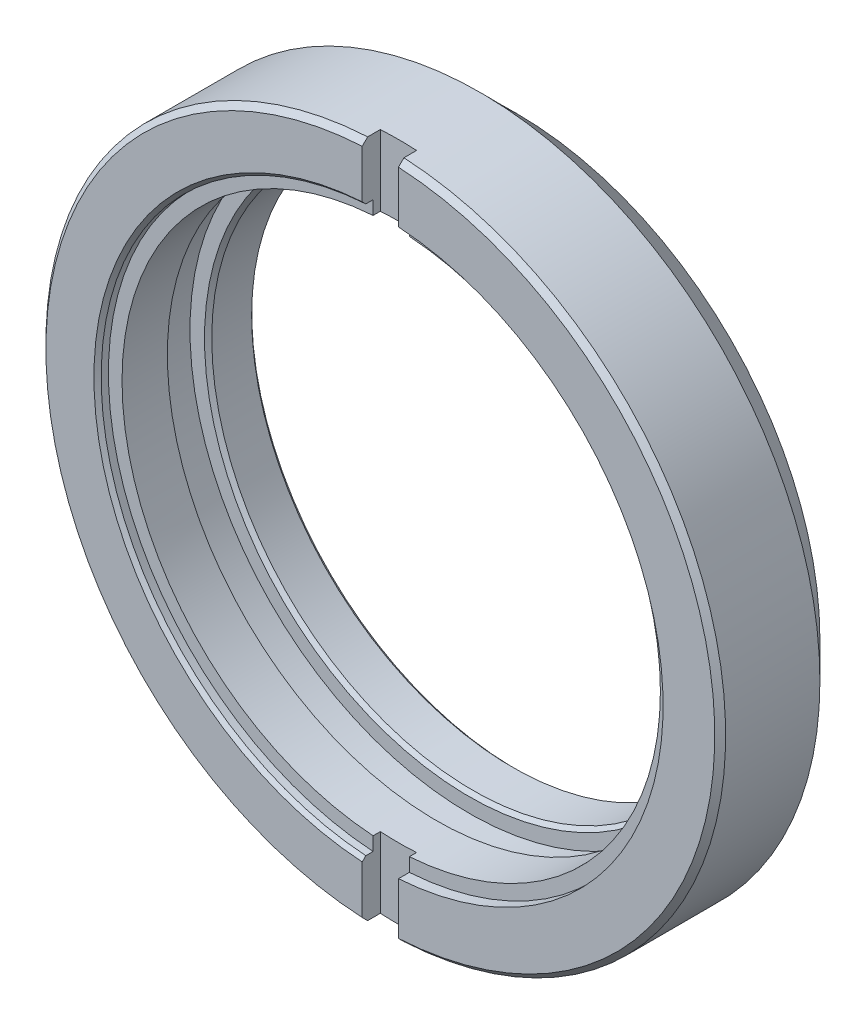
ISO-10303-21;
HEADER;
FILE_DESCRIPTION(('STEP AP214'),'2;1');
FILE_NAME('part.step','',(''),(''),'','','');
FILE_SCHEMA(('AUTOMOTIVE_DESIGN { 1 0 10303 214 1 1 1 1 }'));
ENDSEC;
DATA;
#1=APPLICATION_CONTEXT('core data for automotive mechanical design processes');
#2=APPLICATION_PROTOCOL_DEFINITION('international standard','automotive_design',2000,#1);
#3=PRODUCT_CONTEXT('',#1,'mechanical');
#4=PRODUCT('Part','Part','',(#3));
#5=PRODUCT_RELATED_PRODUCT_CATEGORY('part','',(#4));
#6=PRODUCT_DEFINITION_FORMATION('','',#4);
#7=PRODUCT_DEFINITION_CONTEXT('part definition',#1,'design');
#8=PRODUCT_DEFINITION('design','',#6,#7);
#9=PRODUCT_DEFINITION_SHAPE('','',#8);
#10=(LENGTH_UNIT() NAMED_UNIT(*) SI_UNIT(.MILLI.,.METRE.));
#11=(NAMED_UNIT(*) PLANE_ANGLE_UNIT() SI_UNIT($,.RADIAN.));
#12=(NAMED_UNIT(*) SI_UNIT($,.STERADIAN.) SOLID_ANGLE_UNIT());
#13=UNCERTAINTY_MEASURE_WITH_UNIT(LENGTH_MEASURE(1.E-05),#10,'distance_accuracy_value','');
#14=(GEOMETRIC_REPRESENTATION_CONTEXT(3) GLOBAL_UNCERTAINTY_ASSIGNED_CONTEXT((#13)) GLOBAL_UNIT_ASSIGNED_CONTEXT((#10,
#11,#12)) REPRESENTATION_CONTEXT('',''));
#15=CARTESIAN_POINT('',(0.,0.,0.));
#16=DIRECTION('',(0.,0.,1.));
#17=DIRECTION('',(1.,0.,0.));
#18=AXIS2_PLACEMENT_3D('',#15,#16,#17);
#19=CARTESIAN_POINT('',(0.,0.,9.525));
#20=DIRECTION('',(0.,0.,1.));
#21=DIRECTION('',(1.,0.,0.));
#22=AXIS2_PLACEMENT_3D('',#19,#20,#21);
#23=PLANE('',#22);
#24=DIRECTION('',(0.,-1.,0.));
#25=VECTOR('',#24,1.);
#26=CARTESIAN_POINT('',(-1.27,25.4,9.525));
#27=LINE('',#26,#25);
#28=CARTESIAN_POINT('',(-1.26999999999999,-20.0257697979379,9.525));
#29=VERTEX_POINT('',#28);
#30=CARTESIAN_POINT('',(-1.26999999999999,-23.397057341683,9.525));
#31=VERTEX_POINT('',#30);
#32=EDGE_CURVE('E165',#29,#31,#27,.T.);
#33=ORIENTED_EDGE('',*,*,#32,.F.);
#34=CARTESIAN_POINT('',(0.,0.,9.525));
#35=DIRECTION('',(0.,0.,1.));
#36=DIRECTION('',(1.,0.,0.));
#37=AXIS2_PLACEMENT_3D('',#34,#35,#36);
#38=CIRCLE('',#37,20.066);
#39=CARTESIAN_POINT('',(-1.27,20.0257697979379,9.525));
#40=VERTEX_POINT('',#39);
#41=EDGE_CURVE('E51',#29,#40,#38,.F.);
#42=ORIENTED_EDGE('',*,*,#41,.T.);
#43=CARTESIAN_POINT('',(-1.27,23.397057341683,9.525));
#44=VERTEX_POINT('',#43);
#45=EDGE_CURVE('E150',#44,#40,#27,.T.);
#46=ORIENTED_EDGE('',*,*,#45,.F.);
#47=CARTESIAN_POINT('',(0.,0.,9.525));
#48=DIRECTION('',(0.,0.,1.));
#49=DIRECTION('',(1.,0.,0.));
#50=AXIS2_PLACEMENT_3D('',#47,#48,#49);
#51=CIRCLE('',#50,23.4315000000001);
#52=EDGE_CURVE('E163',#44,#31,#51,.T.);
#53=ORIENTED_EDGE('',*,*,#52,.T.);
#54=EDGE_LOOP('',(#33,#42,#46,#53));
#55=FACE_BOUND('',#54,.T.);
#56=ADVANCED_FACE('F37',(#55),#23,.T.);
#57=CARTESIAN_POINT('',(0.,0.,8.763));
#58=DIRECTION('',(0.,0.,1.));
#59=DIRECTION('',(1.,0.,0.));
#60=AXIS2_PLACEMENT_3D('',#57,#58,#59);
#61=CYLINDRICAL_SURFACE('',#60,19.812);
#62=DIRECTION('',(0.,0.,1.));
#63=VECTOR('',#62,1.);
#64=CARTESIAN_POINT('',(-1.27,19.7712529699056,8.763));
#65=LINE('',#64,#63);
#66=CARTESIAN_POINT('',(-1.27,19.7712529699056,8.763));
#67=VERTEX_POINT('',#66);
#68=CARTESIAN_POINT('',(-1.27,19.7712529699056,9.27099999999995));
#69=VERTEX_POINT('',#68);
#70=EDGE_CURVE('E277',#67,#69,#65,.T.);
#71=ORIENTED_EDGE('',*,*,#70,.T.);
#72=CARTESIAN_POINT('',(0.,0.,9.27099999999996));
#73=DIRECTION('',(0.,0.,1.));
#74=DIRECTION('',(1.,0.,0.));
#75=AXIS2_PLACEMENT_3D('',#72,#73,#74);
#76=CIRCLE('',#75,19.812);
#77=CARTESIAN_POINT('',(-1.26999999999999,-19.7712529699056,9.27099999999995));
#78=VERTEX_POINT('',#77);
#79=EDGE_CURVE('E221',#69,#78,#76,.T.);
#80=ORIENTED_EDGE('',*,*,#79,.T.);
#81=DIRECTION('',(0.,0.,1.));
#82=VECTOR('',#81,1.);
#83=CARTESIAN_POINT('',(-1.26999999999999,-19.7712529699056,8.763));
#84=LINE('',#83,#82);
#85=CARTESIAN_POINT('',(-1.26999999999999,-19.7712529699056,8.763));
#86=VERTEX_POINT('',#85);
#87=EDGE_CURVE('E279',#78,#86,#84,.F.);
#88=ORIENTED_EDGE('',*,*,#87,.T.);
#89=CARTESIAN_POINT('',(0.,0.,8.763));
#90=DIRECTION('',(0.,0.,1.));
#91=DIRECTION('',(1.,0.,0.));
#92=AXIS2_PLACEMENT_3D('',#89,#90,#91);
#93=CIRCLE('',#92,19.812);
#94=EDGE_CURVE('E176',#67,#86,#93,.T.);
#95=ORIENTED_EDGE('',*,*,#94,.F.);
#96=EDGE_LOOP('',(#71,#80,#88,#95));
#97=FACE_BOUND('',#96,.T.);
#98=ADVANCED_FACE('F339',(#97),#61,.F.);
#99=CARTESIAN_POINT('',(0.,0.,8.763));
#100=DIRECTION('',(0.,0.,1.));
#101=DIRECTION('',(1.,0.,0.));
#102=AXIS2_PLACEMENT_3D('',#99,#100,#101);
#103=PLANE('',#102);
#104=DIRECTION('',(0.,-1.,0.));
#105=VECTOR('',#104,1.);
#106=CARTESIAN_POINT('',(-1.27,0.,8.763));
#107=LINE('',#106,#105);
#108=CARTESIAN_POINT('',(-1.27,18.816690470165,8.763));
#109=VERTEX_POINT('',#108);
#110=EDGE_CURVE('E281',#67,#109,#107,.T.);
#111=ORIENTED_EDGE('',*,*,#110,.F.);
#112=ORIENTED_EDGE('',*,*,#94,.T.);
#113=CARTESIAN_POINT('',(-1.26999999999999,-18.816690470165,8.763));
#114=VERTEX_POINT('',#113);
#115=EDGE_CURVE('E276',#114,#86,#107,.T.);
#116=ORIENTED_EDGE('',*,*,#115,.F.);
#117=CARTESIAN_POINT('',(0.,0.,8.763));
#118=DIRECTION('',(0.,0.,1.));
#119=DIRECTION('',(1.,0.,0.));
#120=AXIS2_PLACEMENT_3D('',#117,#118,#119);
#121=CIRCLE('',#120,18.8595);
#122=EDGE_CURVE('E275',#109,#114,#121,.T.);
#123=ORIENTED_EDGE('',*,*,#122,.F.);
#124=EDGE_LOOP('',(#111,#112,#116,#123));
#125=FACE_BOUND('',#124,.T.);
#126=ADVANCED_FACE('F337',(#125),#103,.T.);
#127=CARTESIAN_POINT('',(0.,0.,9.525));
#128=DIRECTION('',(0.,0.,-1.));
#129=DIRECTION('',(-1.,0.,0.));
#130=AXIS2_PLACEMENT_3D('',#127,#128,#129);
#131=CONICAL_SURFACE('',#130,23.4315000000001,0.785398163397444);
#132=CARTESIAN_POINT('',(-1.27,52.3732185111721,-19.43211438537));
#133=CARTESIAN_POINT('',(-1.27,50.5669869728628,-17.6264180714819));
#134=CARTESIAN_POINT('',(-1.27,48.7607321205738,-15.8207450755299));
#135=CARTESIAN_POINT('',(-1.27,45.1481445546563,-12.2094756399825));
#136=CARTESIAN_POINT('',(-1.27,43.3418118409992,-10.4038792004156));
#137=CARTESIAN_POINT('',(-1.27,39.7290233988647,-6.79277888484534));
#138=CARTESIAN_POINT('',(-1.27,37.9225676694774,-4.98727500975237));
#139=CARTESIAN_POINT('',(-1.27,34.3094935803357,-1.37643128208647));
#140=CARTESIAN_POINT('',(-1.27,32.5028752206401,0.428908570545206));
#141=CARTESIAN_POINT('',(-1.27,28.8846357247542,4.04405480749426));
#142=CARTESIAN_POINT('',(-1.27,27.0730138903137,5.85386049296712));
#143=CARTESIAN_POINT('',(-1.27,23.4493059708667,9.47301093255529));
#144=CARTESIAN_POINT('',(-1.27,21.6372198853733,11.2823556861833));
#145=CARTESIAN_POINT('',(-1.27,18.9183674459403,13.995638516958));
#146=CARTESIAN_POINT('',(-1.27,18.0119651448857,14.8999413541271));
#147=CARTESIAN_POINT('',(-1.27,16.1987724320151,16.7081586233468));
#148=CARTESIAN_POINT('',(-1.27,15.2919820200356,17.6120730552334));
#149=CARTESIAN_POINT('',(-1.27,13.477771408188,19.4192664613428));
#150=CARTESIAN_POINT('',(-1.27,12.5703512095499,20.3225454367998));
#151=CARTESIAN_POINT('',(-1.27,11.2083226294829,21.6765597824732));
#152=CARTESIAN_POINT('',(-1.27,10.7541635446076,22.1277470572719));
#153=CARTESIAN_POINT('',(-1.27,9.84540588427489,23.0296787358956));
#154=CARTESIAN_POINT('',(-1.27,9.39080730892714,23.480423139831));
#155=CARTESIAN_POINT('',(-1.27,8.68687210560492,24.1773522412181));
#156=CARTESIAN_POINT('',(-1.27,8.43777023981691,24.4237740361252));
#157=CARTESIAN_POINT('',(-1.27,7.93930374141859,24.9163519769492));
#158=CARTESIAN_POINT('',(-1.27,7.6899391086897,25.1625081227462));
#159=CARTESIAN_POINT('',(-1.27,7.19093909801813,25.6543951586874));
#160=CARTESIAN_POINT('',(-1.27,6.9413038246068,25.9001261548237));
#161=CARTESIAN_POINT('',(-1.27,6.44155850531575,26.3911043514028));
#162=CARTESIAN_POINT('',(-1.27,6.19144845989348,26.6363515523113));
#163=CARTESIAN_POINT('',(-1.27,5.60594682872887,27.2089324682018));
#164=CARTESIAN_POINT('',(-1.27,5.27029571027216,27.5360013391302));
#165=CARTESIAN_POINT('',(-1.27,4.76520617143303,28.0251353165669));
#166=CARTESIAN_POINT('',(-1.27,4.59652520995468,28.1879819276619));
#167=CARTESIAN_POINT('',(-1.27,4.25845992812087,28.5129411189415));
#168=CARTESIAN_POINT('',(-1.27,4.08907561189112,28.6750537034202));
#169=CARTESIAN_POINT('',(-1.27,3.69171843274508,29.0530831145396));
#170=CARTESIAN_POINT('',(-1.27,3.4633612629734,29.2685980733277));
#171=CARTESIAN_POINT('',(-1.27,3.118785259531,29.5893048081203));
#172=CARTESIAN_POINT('',(-1.27,3.00368141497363,29.6956935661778));
#173=CARTESIAN_POINT('',(-1.27,2.77246129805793,29.9073599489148));
#174=CARTESIAN_POINT('',(-1.27,2.65634506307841,30.0126376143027));
#175=CARTESIAN_POINT('',(-1.27,2.46135241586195,30.1870340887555));
#176=CARTESIAN_POINT('',(-1.27,2.38286764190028,30.2565903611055));
#177=CARTESIAN_POINT('',(-1.27,2.22508436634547,30.3947728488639));
#178=CARTESIAN_POINT('',(-1.27,2.14578588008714,30.463399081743));
#179=CARTESIAN_POINT('',(-1.27,1.98571326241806,30.5997674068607));
#180=CARTESIAN_POINT('',(-1.27,1.90493358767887,30.6675030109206));
#181=CARTESIAN_POINT('',(-1.27,1.74197276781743,30.8012280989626));
#182=CARTESIAN_POINT('',(-1.27,1.65979202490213,30.8672180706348));
#183=CARTESIAN_POINT('',(-1.27,1.49261318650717,30.997417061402));
#184=CARTESIAN_POINT('',(-1.27,1.40759443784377,31.061599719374));
#185=CARTESIAN_POINT('',(-1.27,1.23467633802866,31.1862679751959));
#186=CARTESIAN_POINT('',(-1.27,1.14677335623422,31.2467486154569));
#187=CARTESIAN_POINT('',(-1.27,0.967758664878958,31.361278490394));
#188=CARTESIAN_POINT('',(-1.27,0.876676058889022,31.4153726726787));
#189=CARTESIAN_POINT('',(-1.27,0.689355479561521,31.5136610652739));
#190=CARTESIAN_POINT('',(-1.27,0.593134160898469,31.55788510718));
#191=CARTESIAN_POINT('',(-1.27,0.456123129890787,31.6075300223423));
#192=CARTESIAN_POINT('',(-1.27,0.417903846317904,31.6200215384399));
#193=CARTESIAN_POINT('',(-1.27,0.340629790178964,31.6421345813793));
#194=CARTESIAN_POINT('',(-1.27,0.301574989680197,31.651756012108));
#195=CARTESIAN_POINT('',(-1.27,0.222934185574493,31.6676538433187));
#196=CARTESIAN_POINT('',(-1.27,0.183350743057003,31.6739427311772));
#197=CARTESIAN_POINT('',(-1.27,0.103776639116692,31.6828800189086));
#198=CARTESIAN_POINT('',(-1.27,0.0637860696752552,31.6855292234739));
#199=CARTESIAN_POINT('',(-1.27,-0.0164801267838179,31.6870303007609));
#200=CARTESIAN_POINT('',(-1.27,-0.0567561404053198,31.6858619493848));
#201=CARTESIAN_POINT('',(-1.27,-0.137018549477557,31.6797573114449));
#202=CARTESIAN_POINT('',(-1.27,-0.177004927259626,31.6748207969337));
#203=CARTESIAN_POINT('',(-1.27,-0.256510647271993,31.6614495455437));
#204=CARTESIAN_POINT('',(-1.27,-0.29602809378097,31.653003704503));
#205=CARTESIAN_POINT('',(-1.27,-0.374269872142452,31.6330400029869));
#206=CARTESIAN_POINT('',(-1.27,-0.412994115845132,31.6215218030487));
#207=CARTESIAN_POINT('',(-1.27,-0.530517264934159,31.5821764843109));
#208=CARTESIAN_POINT('',(-1.27,-0.607886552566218,31.5500809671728));
#209=CARTESIAN_POINT('',(-1.27,-0.75910042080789,31.4784341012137));
#210=CARTESIAN_POINT('',(-1.27,-0.832938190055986,31.4388690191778));
#211=CARTESIAN_POINT('',(-1.27,-0.978284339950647,31.3544952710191));
#212=CARTESIAN_POINT('',(-1.27,-1.04977023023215,31.3096483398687));
#213=CARTESIAN_POINT('',(-1.27,-1.15526138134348,31.2398633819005));
#214=CARTESIAN_POINT('',(-1.27,-1.19012177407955,31.2161926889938));
#215=CARTESIAN_POINT('',(-1.27,-1.25934743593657,31.1681390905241));
#216=CARTESIAN_POINT('',(-1.27,-1.29371272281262,31.1437562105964));
#217=CARTESIAN_POINT('',(-1.27,-1.40233300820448,31.0652628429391));
#218=CARTESIAN_POINT('',(-1.27,-1.47578391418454,31.0100405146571));
#219=CARTESIAN_POINT('',(-1.27,-1.62116665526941,30.8976251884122));
#220=CARTESIAN_POINT('',(-1.27,-1.69309824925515,30.8404318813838));
#221=CARTESIAN_POINT('',(-1.27,-1.83583108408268,30.7245867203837));
#222=CARTESIAN_POINT('',(-1.27,-1.90663176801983,30.6659341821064));
#223=CARTESIAN_POINT('',(-1.27,-2.0473299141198,30.5475538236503));
#224=CARTESIAN_POINT('',(-1.27,-2.11722734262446,30.487825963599));
#225=CARTESIAN_POINT('',(-1.27,-2.32610511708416,30.3072121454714));
#226=CARTESIAN_POINT('',(-1.27,-2.46402374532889,30.1850997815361));
#227=CARTESIAN_POINT('',(-1.27,-2.73799613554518,29.9388924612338));
#228=CARTESIAN_POINT('',(-1.27,-2.87405041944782,29.8147980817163));
#229=CARTESIAN_POINT('',(-1.27,-3.14449019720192,29.5656349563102));
#230=CARTESIAN_POINT('',(-1.27,-3.27887953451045,29.4405703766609));
#231=CARTESIAN_POINT('',(-1.27,-3.54678100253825,29.1894877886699));
#232=CARTESIAN_POINT('',(-1.27,-3.68029306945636,29.0634697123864));
#233=CARTESIAN_POINT('',(-1.27,-3.94652079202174,28.8108805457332));
#234=CARTESIAN_POINT('',(-1.27,-4.07923714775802,28.6843101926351));
#235=CARTESIAN_POINT('',(-1.27,-4.34417118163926,28.4306554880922));
#236=CARTESIAN_POINT('',(-1.27,-4.47638887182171,28.3035711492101));
#237=CARTESIAN_POINT('',(-1.27,-4.87128234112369,27.9228759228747));
#238=CARTESIAN_POINT('',(-1.27,-5.13339596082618,27.6686820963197));
#239=CARTESIAN_POINT('',(-1.27,-5.6566738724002,27.1593187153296));
#240=CARTESIAN_POINT('',(-1.27,-5.91783816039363,26.9041491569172));
#241=CARTESIAN_POINT('',(-1.27,-6.43952511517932,26.3931452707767));
#242=CARTESIAN_POINT('',(-1.27,-6.70004776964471,26.137310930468));
#243=CARTESIAN_POINT('',(-1.27,-7.22063494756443,25.6251764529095));
#244=CARTESIAN_POINT('',(-1.27,-7.48069947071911,25.3688763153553));
#245=CARTESIAN_POINT('',(-1.27,-8.26062032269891,24.5992532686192));
#246=CARTESIAN_POINT('',(-1.27,-8.77998020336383,24.0854273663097));
#247=CARTESIAN_POINT('',(-1.27,-9.8179329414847,23.0570112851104));
#248=CARTESIAN_POINT('',(-1.27,-10.3365258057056,22.5424211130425));
#249=CARTESIAN_POINT('',(-1.27,-11.3732633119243,21.5127074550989));
#250=CARTESIAN_POINT('',(-1.27,-11.8914079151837,20.9975839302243));
#251=CARTESIAN_POINT('',(-1.27,-12.9273684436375,19.9670040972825));
#252=CARTESIAN_POINT('',(-1.27,-13.4451843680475,19.4515477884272));
#253=CARTESIAN_POINT('',(-1.27,-14.9981407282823,17.9049811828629));
#254=CARTESIAN_POINT('',(-1.27,-16.0329377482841,16.8735260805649));
#255=CARTESIAN_POINT('',(-1.26999999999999,-18.5402176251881,14.3731551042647));
#256=CARTESIAN_POINT('',(-1.26999999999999,-20.0124487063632,12.9039868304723));
#257=CARTESIAN_POINT('',(-1.26999999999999,-22.9564096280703,9.96514732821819));
#258=CARTESIAN_POINT('',(-1.26999999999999,-24.4281394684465,8.4954760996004));
#259=CARTESIAN_POINT('',(-1.26999999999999,-27.3713959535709,5.55575117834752));
#260=CARTESIAN_POINT('',(-1.26999999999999,-28.8429225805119,4.08569746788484));
#261=CARTESIAN_POINT('',(-1.26999999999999,-31.7857915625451,1.14540590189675));
#262=CARTESIAN_POINT('',(-1.26999999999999,-33.2571339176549,-0.324831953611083));
#263=CARTESIAN_POINT('',(-1.26999999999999,-37.6696387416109,-4.73438514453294));
#264=CARTESIAN_POINT('',(-1.26999999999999,-40.6106210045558,-7.67388080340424));
#265=CARTESIAN_POINT('',(-1.26999999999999,-45.0218243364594,-12.0832143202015));
#266=CARTESIAN_POINT('',(-1.26999999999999,-46.4921354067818,-13.5529621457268));
#267=CARTESIAN_POINT('',(-1.26999999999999,-49.432709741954,-16.4925055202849));
#268=CARTESIAN_POINT('',(-1.26999999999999,-50.9029730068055,-17.9623010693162));
#269=CARTESIAN_POINT('',(-1.26999999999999,-52.3732185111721,-19.43211438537));
#270=B_SPLINE_CURVE_WITH_KNOTS('',3,(#132,#133,#134,#135,#136,#137,#138,#139,#140,#141,#142,
#143,#144,#145,#146,#147,#148,#149,#150,#151,#152,#153,#154,#155,#156,#157,#158,#159,#160,#161,
#162,#163,#164,#165,#166,#167,#168,#169,#170,#171,#172,#173,#174,#175,#176,#177,#178,#179,#180,
#181,#182,#183,#184,#185,#186,#187,#188,#189,#190,#191,#192,#193,#194,#195,#196,#197,#198,#199,
#200,#201,#202,#203,#204,#205,#206,#207,#208,#209,#210,#211,#212,#213,#214,#215,#216,#217,#218,
#219,#220,#221,#222,#223,#224,#225,#226,#227,#228,#229,#230,#231,#232,#233,#234,#235,#236,#237,
#238,#239,#240,#241,#242,#243,#244,#245,#246,#247,#248,#249,#250,#251,#252,#253,#254,#255,#256,
#257,#258,#259,#260,#261,#262,#263,#264,#265,#266,#267,#268,#269),.UNSPECIFIED.,.F.,.F.,(4,2,2,
2,2,2,2,2,2,2,2,2,2,2,2,2,2,2,2,2,2,2,2,2,2,2,2,2,2,2,2,2,2,2,2,2,2,2,2,2,2,2,2,2,2,2,2,2,2,2,2,
2,2,2,2,2,2,2,2,2,2,2,2,2,2,2,2,2,4),(0.,7.66205611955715,15.3241150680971,22.9862387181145,
30.6483596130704,38.3305684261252,46.0127853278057,49.8538734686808,53.6949632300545,
57.53604551,59.456585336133,61.3771246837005,62.4283043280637,63.4794844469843,64.5303470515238,
65.5812086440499,66.9871617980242,67.6905449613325,68.3939240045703,69.3358909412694,
69.8061067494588,70.2763052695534,70.5909130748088,70.905514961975,71.2217596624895,
71.5379150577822,71.8574284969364,72.1773608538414,72.4948871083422,72.8114402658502,
72.9319757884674,73.0525153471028,73.1725999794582,73.2926580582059,73.4133531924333,
73.5340556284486,73.6551429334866,73.7762436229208,74.0268487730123,74.2779192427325,
74.5309357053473,74.6573420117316,74.7837437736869,75.0593723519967,75.3350443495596,
75.6108481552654,75.8866622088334,76.4392512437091,76.9916822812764,77.5424156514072,
78.093188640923,78.6433714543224,79.1935409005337,80.2889184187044,81.3843004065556,
82.4797032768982,83.5751068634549,85.7668546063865,87.9585829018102,90.1504847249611,
92.3423917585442,96.7255797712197,102.965233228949,109.204888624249,115.444923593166,
121.684957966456,134.159335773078,140.396142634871,146.632949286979),.UNSPECIFIED.);
#271=CARTESIAN_POINT('',(-1.27,23.778609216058,9.14400000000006));
#272=VERTEX_POINT('',#271);
#273=EDGE_CURVE('E148',#272,#44,#270,.T.);
#274=ORIENTED_EDGE('',*,*,#273,.F.);
#275=CARTESIAN_POINT('',(0.,0.,9.14400000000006));
#276=DIRECTION('',(0.,0.,1.));
#277=DIRECTION('',(1.,0.,0.));
#278=AXIS2_PLACEMENT_3D('',#275,#276,#277);
#279=CIRCLE('',#278,23.8125);
#280=CARTESIAN_POINT('',(-1.26999999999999,-23.778609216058,9.14400000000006));
#281=VERTEX_POINT('',#280);
#282=EDGE_CURVE('E173',#281,#272,#279,.F.);
#283=ORIENTED_EDGE('',*,*,#282,.F.);
#284=EDGE_CURVE('E160',#31,#281,#270,.T.);
#285=ORIENTED_EDGE('',*,*,#284,.F.);
#286=ORIENTED_EDGE('',*,*,#52,.F.);
#287=EDGE_LOOP('',(#274,#283,#285,#286));
#288=FACE_BOUND('',#287,.T.);
#289=ADVANCED_FACE('F168',(#288),#131,.T.);
#290=CARTESIAN_POINT('',(0.,0.,9.525));
#291=DIRECTION('',(0.,0.,-1.));
#292=DIRECTION('',(-1.,0.,0.));
#293=AXIS2_PLACEMENT_3D('',#290,#291,#292);
#294=CYLINDRICAL_SURFACE('',#293,23.8125);
#295=CARTESIAN_POINT('',(0.,0.,2.54000000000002));
#296=DIRECTION('',(0.,0.,1.));
#297=DIRECTION('',(1.,0.,0.));
#298=AXIS2_PLACEMENT_3D('',#295,#296,#297);
#299=CIRCLE('',#298,23.8125);
#300=CARTESIAN_POINT('',(23.8125,0.,2.54000000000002));
#301=VERTEX_POINT('',#300);
#302=EDGE_CURVE('E243',#301,#301,#299,.T.);
#303=ORIENTED_EDGE('',*,*,#302,.T.);
#304=EDGE_LOOP('',(#303));
#305=FACE_BOUND('',#304,.T.);
#306=ORIENTED_EDGE('',*,*,#282,.T.);
#307=DIRECTION('',(0.,0.,-1.));
#308=VECTOR('',#307,1.);
#309=CARTESIAN_POINT('',(-1.27,23.778609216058,9.525));
#310=LINE('',#309,#308);
#311=CARTESIAN_POINT('',(-1.27,23.778609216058,8.255));
#312=VERTEX_POINT('',#311);
#313=EDGE_CURVE('E154',#272,#312,#310,.T.);
#314=ORIENTED_EDGE('',*,*,#313,.T.);
#315=CARTESIAN_POINT('',(0.,0.,8.255));
#316=DIRECTION('',(0.,0.,1.));
#317=DIRECTION('',(1.,0.,0.));
#318=AXIS2_PLACEMENT_3D('',#315,#316,#317);
#319=CIRCLE('',#318,23.8125);
#320=CARTESIAN_POINT('',(1.27,23.778609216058,8.255));
#321=VERTEX_POINT('',#320);
#322=EDGE_CURVE('E288',#321,#312,#319,.T.);
#323=ORIENTED_EDGE('',*,*,#322,.F.);
#324=DIRECTION('',(0.,0.,-1.));
#325=VECTOR('',#324,1.);
#326=CARTESIAN_POINT('',(1.27,23.778609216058,9.525));
#327=LINE('',#326,#325);
#328=CARTESIAN_POINT('',(1.27,23.778609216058,9.14400000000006));
#329=VERTEX_POINT('',#328);
#330=EDGE_CURVE('E315',#321,#329,#327,.F.);
#331=ORIENTED_EDGE('',*,*,#330,.T.);
#332=CARTESIAN_POINT('',(1.27000000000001,-23.778609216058,9.14400000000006));
#333=VERTEX_POINT('',#332);
#334=EDGE_CURVE('E169',#329,#333,#279,.F.);
#335=ORIENTED_EDGE('',*,*,#334,.T.);
#336=DIRECTION('',(0.,0.,-1.));
#337=VECTOR('',#336,1.);
#338=CARTESIAN_POINT('',(1.27000000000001,-23.778609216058,9.525));
#339=LINE('',#338,#337);
#340=CARTESIAN_POINT('',(1.27000000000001,-23.778609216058,8.255));
#341=VERTEX_POINT('',#340);
#342=EDGE_CURVE('E318',#333,#341,#339,.T.);
#343=ORIENTED_EDGE('',*,*,#342,.T.);
#344=CARTESIAN_POINT('',(-1.26999999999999,-23.778609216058,8.255));
#345=VERTEX_POINT('',#344);
#346=EDGE_CURVE('E286',#345,#341,#319,.T.);
#347=ORIENTED_EDGE('',*,*,#346,.F.);
#348=DIRECTION('',(0.,0.,-1.));
#349=VECTOR('',#348,1.);
#350=CARTESIAN_POINT('',(-1.26999999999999,-23.778609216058,9.525));
#351=LINE('',#350,#349);
#352=EDGE_CURVE('E267',#345,#281,#351,.F.);
#353=ORIENTED_EDGE('',*,*,#352,.T.);
#354=EDGE_LOOP('',(#306,#314,#323,#331,#335,#343,#347,#353));
#355=FACE_BOUND('',#354,.T.);
#356=ADVANCED_FACE('F359',(#305,#355),#294,.T.);
#357=DIRECTION('',(0.,1.,0.));
#358=VECTOR('',#357,1.);
#359=CARTESIAN_POINT('',(1.27,25.4,9.525));
#360=LINE('',#359,#358);
#361=CARTESIAN_POINT('',(1.27000000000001,-23.397057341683,9.525));
#362=VERTEX_POINT('',#361);
#363=CARTESIAN_POINT('',(1.27000000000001,-19.7712529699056,9.525));
#364=VERTEX_POINT('',#363);
#365=EDGE_CURVE('E269',#362,#364,#360,.T.);
#366=ORIENTED_EDGE('',*,*,#365,.F.);
#367=CARTESIAN_POINT('',(1.27,23.397057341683,9.525));
#368=VERTEX_POINT('',#367);
#369=EDGE_CURVE('E170',#362,#368,#51,.T.);
#370=ORIENTED_EDGE('',*,*,#369,.T.);
#371=CARTESIAN_POINT('',(1.27,19.7712529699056,9.525));
#372=VERTEX_POINT('',#371);
#373=EDGE_CURVE('E164',#372,#368,#360,.T.);
#374=ORIENTED_EDGE('',*,*,#373,.F.);
#375=CARTESIAN_POINT('',(0.,0.,9.525));
#376=DIRECTION('',(0.,0.,1.));
#377=DIRECTION('',(1.,0.,0.));
#378=AXIS2_PLACEMENT_3D('',#375,#376,#377);
#379=CIRCLE('',#378,19.812);
#380=EDGE_CURVE('E178',#364,#372,#379,.T.);
#381=ORIENTED_EDGE('',*,*,#380,.F.);
#382=EDGE_LOOP('',(#366,#370,#374,#381));
#383=FACE_BOUND('',#382,.T.);
#384=ADVANCED_FACE('F309',(#383),#23,.T.);
#385=CARTESIAN_POINT('',(0.,0.,0.));
#386=DIRECTION('',(0.,0.,1.));
#387=DIRECTION('',(1.,0.,0.));
#388=AXIS2_PLACEMENT_3D('',#385,#386,#387);
#389=PLANE('',#388);
#390=CARTESIAN_POINT('',(0.,0.,0.));
#391=DIRECTION('',(0.,0.,1.));
#392=DIRECTION('',(1.,0.,0.));
#393=AXIS2_PLACEMENT_3D('',#390,#391,#392);
#394=CIRCLE('',#393,18.542);
#395=CARTESIAN_POINT('',(18.542,0.,0.));
#396=VERTEX_POINT('',#395);
#397=EDGE_CURVE('E224',#396,#396,#394,.T.);
#398=ORIENTED_EDGE('',*,*,#397,.T.);
#399=EDGE_LOOP('',(#398));
#400=FACE_BOUND('',#399,.T.);
#401=CARTESIAN_POINT('',(0.,0.,0.));
#402=DIRECTION('',(0.,0.,1.));
#403=DIRECTION('',(1.,0.,0.));
#404=AXIS2_PLACEMENT_3D('',#401,#402,#403);
#405=CIRCLE('',#404,21.2725);
#406=CARTESIAN_POINT('',(21.2725,0.,0.));
#407=VERTEX_POINT('',#406);
#408=EDGE_CURVE('E236',#407,#407,#405,.F.);
#409=ORIENTED_EDGE('',*,*,#408,.T.);
#410=EDGE_LOOP('',(#409));
#411=FACE_BOUND('',#410,.T.);
#412=ADVANCED_FACE('F358',(#400,#411),#389,.F.);
#413=ORIENTED_EDGE('',*,*,#380,.T.);
#414=DIRECTION('',(0.,0.,1.));
#415=VECTOR('',#414,1.);
#416=CARTESIAN_POINT('',(1.27,19.7712529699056,8.763));
#417=LINE('',#416,#415);
#418=CARTESIAN_POINT('',(1.27,19.7712529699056,8.763));
#419=VERTEX_POINT('',#418);
#420=EDGE_CURVE('E304',#372,#419,#417,.F.);
#421=ORIENTED_EDGE('',*,*,#420,.T.);
#422=CARTESIAN_POINT('',(1.27000000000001,-19.7712529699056,8.763));
#423=VERTEX_POINT('',#422);
#424=EDGE_CURVE('E291',#423,#419,#93,.T.);
#425=ORIENTED_EDGE('',*,*,#424,.F.);
#426=DIRECTION('',(0.,0.,1.));
#427=VECTOR('',#426,1.);
#428=CARTESIAN_POINT('',(1.27000000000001,-19.7712529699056,8.763));
#429=LINE('',#428,#427);
#430=EDGE_CURVE('E305',#423,#364,#429,.T.);
#431=ORIENTED_EDGE('',*,*,#430,.T.);
#432=EDGE_LOOP('',(#413,#421,#425,#431));
#433=FACE_BOUND('',#432,.T.);
#434=ADVANCED_FACE('F303',(#433),#61,.F.);
#435=DIRECTION('',(0.,1.,0.));
#436=VECTOR('',#435,1.);
#437=CARTESIAN_POINT('',(1.27,0.,8.763));
#438=LINE('',#437,#436);
#439=CARTESIAN_POINT('',(1.27000000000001,-18.816690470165,8.763));
#440=VERTEX_POINT('',#439);
#441=EDGE_CURVE('E323',#423,#440,#438,.T.);
#442=ORIENTED_EDGE('',*,*,#441,.F.);
#443=ORIENTED_EDGE('',*,*,#424,.T.);
#444=CARTESIAN_POINT('',(1.27,18.816690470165,8.763));
#445=VERTEX_POINT('',#444);
#446=EDGE_CURVE('E325',#445,#419,#438,.T.);
#447=ORIENTED_EDGE('',*,*,#446,.F.);
#448=EDGE_CURVE('E289',#440,#445,#121,.T.);
#449=ORIENTED_EDGE('',*,*,#448,.F.);
#450=EDGE_LOOP('',(#442,#443,#447,#449));
#451=FACE_BOUND('',#450,.T.);
#452=ADVANCED_FACE('F397',(#451),#103,.T.);
#453=CARTESIAN_POINT('',(0.,0.,3.302));
#454=DIRECTION('',(0.,0.,1.));
#455=DIRECTION('',(1.,0.,0.));
#456=AXIS2_PLACEMENT_3D('',#453,#454,#455);
#457=CYLINDRICAL_SURFACE('',#456,18.8595);
#458=CARTESIAN_POINT('',(0.,0.,5.588));
#459=DIRECTION('',(0.,0.,1.));
#460=DIRECTION('',(1.,0.,0.));
#461=AXIS2_PLACEMENT_3D('',#458,#459,#460);
#462=CIRCLE('',#461,18.8595);
#463=CARTESIAN_POINT('',(18.8595,0.,5.588));
#464=VERTEX_POINT('',#463);
#465=EDGE_CURVE('E237',#464,#464,#462,.F.);
#466=ORIENTED_EDGE('',*,*,#465,.T.);
#467=EDGE_LOOP('',(#466));
#468=FACE_BOUND('',#467,.T.);
#469=ORIENTED_EDGE('',*,*,#122,.T.);
#470=DIRECTION('',(0.,0.,1.));
#471=VECTOR('',#470,1.);
#472=CARTESIAN_POINT('',(-1.26999999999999,-18.816690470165,3.302));
#473=LINE('',#472,#471);
#474=CARTESIAN_POINT('',(-1.26999999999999,-18.816690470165,8.255));
#475=VERTEX_POINT('',#474);
#476=EDGE_CURVE('E264',#114,#475,#473,.F.);
#477=ORIENTED_EDGE('',*,*,#476,.T.);
#478=CARTESIAN_POINT('',(0.,0.,8.255));
#479=DIRECTION('',(0.,0.,1.));
#480=DIRECTION('',(1.,0.,0.));
#481=AXIS2_PLACEMENT_3D('',#478,#479,#480);
#482=CIRCLE('',#481,18.8595);
#483=CARTESIAN_POINT('',(1.27000000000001,-18.816690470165,8.255));
#484=VERTEX_POINT('',#483);
#485=EDGE_CURVE('E245',#484,#475,#482,.F.);
#486=ORIENTED_EDGE('',*,*,#485,.F.);
#487=DIRECTION('',(0.,0.,1.));
#488=VECTOR('',#487,1.);
#489=CARTESIAN_POINT('',(1.27000000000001,-18.816690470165,3.302));
#490=LINE('',#489,#488);
#491=EDGE_CURVE('E321',#484,#440,#490,.T.);
#492=ORIENTED_EDGE('',*,*,#491,.T.);
#493=ORIENTED_EDGE('',*,*,#448,.T.);
#494=DIRECTION('',(0.,0.,1.));
#495=VECTOR('',#494,1.);
#496=CARTESIAN_POINT('',(1.27,18.816690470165,3.302));
#497=LINE('',#496,#495);
#498=CARTESIAN_POINT('',(1.27,18.816690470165,8.255));
#499=VERTEX_POINT('',#498);
#500=EDGE_CURVE('E327',#445,#499,#497,.F.);
#501=ORIENTED_EDGE('',*,*,#500,.T.);
#502=CARTESIAN_POINT('',(-1.27,18.816690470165,8.255));
#503=VERTEX_POINT('',#502);
#504=EDGE_CURVE('E159',#503,#499,#482,.F.);
#505=ORIENTED_EDGE('',*,*,#504,.F.);
#506=DIRECTION('',(0.,0.,1.));
#507=VECTOR('',#506,1.);
#508=CARTESIAN_POINT('',(-1.27,18.816690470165,3.302));
#509=LINE('',#508,#507);
#510=EDGE_CURVE('E333',#503,#109,#509,.T.);
#511=ORIENTED_EDGE('',*,*,#510,.T.);
#512=EDGE_LOOP('',(#469,#477,#486,#492,#493,#501,#505,#511));
#513=FACE_BOUND('',#512,.T.);
#514=ADVANCED_FACE('F272',(#468,#513),#457,.F.);
#515=CARTESIAN_POINT('',(0.,0.,3.302));
#516=DIRECTION('',(0.,0.,1.));
#517=DIRECTION('',(1.,0.,0.));
#518=AXIS2_PLACEMENT_3D('',#515,#516,#517);
#519=PLANE('',#518);
#520=CARTESIAN_POINT('',(0.,0.,3.302));
#521=DIRECTION('',(0.,0.,1.));
#522=DIRECTION('',(1.,0.,0.));
#523=AXIS2_PLACEMENT_3D('',#520,#521,#522);
#524=CIRCLE('',#523,18.542);
#525=CARTESIAN_POINT('',(18.542,0.,3.302));
#526=VERTEX_POINT('',#525);
#527=EDGE_CURVE('E227',#526,#526,#524,.F.);
#528=ORIENTED_EDGE('',*,*,#527,.T.);
#529=EDGE_LOOP('',(#528));
#530=FACE_BOUND('',#529,.T.);
#531=CARTESIAN_POINT('',(0.,0.,3.302));
#532=DIRECTION('',(0.,0.,1.));
#533=DIRECTION('',(1.,0.,0.));
#534=AXIS2_PLACEMENT_3D('',#531,#532,#533);
#535=CIRCLE('',#534,19.558);
#536=CARTESIAN_POINT('',(19.558,0.,3.302));
#537=VERTEX_POINT('',#536);
#538=EDGE_CURVE('E379',#537,#537,#535,.T.);
#539=ORIENTED_EDGE('',*,*,#538,.T.);
#540=EDGE_LOOP('',(#539));
#541=FACE_BOUND('',#540,.T.);
#542=ADVANCED_FACE('F396',(#530,#541),#519,.T.);
#543=CARTESIAN_POINT('',(0.,0.,0.));
#544=DIRECTION('',(0.,0.,1.));
#545=DIRECTION('',(1.,0.,0.));
#546=AXIS2_PLACEMENT_3D('',#543,#544,#545);
#547=CYLINDRICAL_SURFACE('',#546,18.288);
#548=CARTESIAN_POINT('',(0.,0.,3.048));
#549=DIRECTION('',(0.,0.,1.));
#550=DIRECTION('',(1.,0.,0.));
#551=AXIS2_PLACEMENT_3D('',#548,#549,#550);
#552=CIRCLE('',#551,18.288);
#553=CARTESIAN_POINT('',(18.288,0.,3.048));
#554=VERTEX_POINT('',#553);
#555=EDGE_CURVE('E230',#554,#554,#552,.T.);
#556=ORIENTED_EDGE('',*,*,#555,.T.);
#557=EDGE_LOOP('',(#556));
#558=FACE_BOUND('',#557,.T.);
#559=CARTESIAN_POINT('',(0.,0.,0.25399999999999));
#560=DIRECTION('',(0.,0.,1.));
#561=DIRECTION('',(1.,0.,0.));
#562=AXIS2_PLACEMENT_3D('',#559,#560,#561);
#563=CIRCLE('',#562,18.288);
#564=CARTESIAN_POINT('',(18.288,0.,0.25399999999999));
#565=VERTEX_POINT('',#564);
#566=EDGE_CURVE('E233',#565,#565,#563,.F.);
#567=ORIENTED_EDGE('',*,*,#566,.T.);
#568=EDGE_LOOP('',(#567));
#569=FACE_BOUND('',#568,.T.);
#570=ADVANCED_FACE('F211',(#558,#569),#547,.F.);
#571=CARTESIAN_POINT('',(1.27000000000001,-52.373218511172,-19.43211438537));
#572=CARTESIAN_POINT('',(1.27000000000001,-50.5669869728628,-17.6264180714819));
#573=CARTESIAN_POINT('',(1.27000000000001,-48.7607321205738,-15.8207450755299));
#574=CARTESIAN_POINT('',(1.27000000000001,-45.1481445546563,-12.2094756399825));
#575=CARTESIAN_POINT('',(1.27000000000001,-43.3418118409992,-10.4038792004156));
#576=CARTESIAN_POINT('',(1.27000000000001,-39.7290233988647,-6.79277888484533));
#577=CARTESIAN_POINT('',(1.27000000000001,-37.9225676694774,-4.98727500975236));
#578=CARTESIAN_POINT('',(1.27000000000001,-34.3094935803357,-1.37643128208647));
#579=CARTESIAN_POINT('',(1.27000000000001,-32.5028752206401,0.428908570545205));
#580=CARTESIAN_POINT('',(1.27000000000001,-28.8846357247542,4.04405480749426));
#581=CARTESIAN_POINT('',(1.27000000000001,-27.0730138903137,5.85386049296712));
#582=CARTESIAN_POINT('',(1.27000000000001,-23.4493059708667,9.47301093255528));
#583=CARTESIAN_POINT('',(1.27000000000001,-21.6372198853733,11.2823556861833));
#584=CARTESIAN_POINT('',(1.27000000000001,-18.9183674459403,13.995638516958));
#585=CARTESIAN_POINT('',(1.27000000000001,-18.0119651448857,14.8999413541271));
#586=CARTESIAN_POINT('',(1.27000000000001,-16.1987724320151,16.7081586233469));
#587=CARTESIAN_POINT('',(1.27000000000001,-15.2919820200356,17.6120730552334));
#588=CARTESIAN_POINT('',(1.27,-13.477771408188,19.4192664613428));
#589=CARTESIAN_POINT('',(1.27,-12.5703512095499,20.3225454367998));
#590=CARTESIAN_POINT('',(1.27,-11.2083226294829,21.6765597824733));
#591=CARTESIAN_POINT('',(1.27,-10.7541635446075,22.1277470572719));
#592=CARTESIAN_POINT('',(1.27,-9.84540588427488,23.0296787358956));
#593=CARTESIAN_POINT('',(1.27,-9.39080730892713,23.480423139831));
#594=CARTESIAN_POINT('',(1.27,-8.68687210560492,24.1773522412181));
#595=CARTESIAN_POINT('',(1.27,-8.4377702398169,24.4237740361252));
#596=CARTESIAN_POINT('',(1.27,-7.93930374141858,24.9163519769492));
#597=CARTESIAN_POINT('',(1.27,-7.6899391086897,25.1625081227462));
#598=CARTESIAN_POINT('',(1.27,-7.19093909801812,25.6543951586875));
#599=CARTESIAN_POINT('',(1.27,-6.94130382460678,25.9001261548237));
#600=CARTESIAN_POINT('',(1.27,-6.44155850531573,26.3911043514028));
#601=CARTESIAN_POINT('',(1.27,-6.19144845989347,26.6363515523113));
#602=CARTESIAN_POINT('',(1.27,-5.60594682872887,27.2089324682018));
#603=CARTESIAN_POINT('',(1.27,-5.27029571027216,27.5360013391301));
#604=CARTESIAN_POINT('',(1.27,-4.76520617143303,28.0251353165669));
#605=CARTESIAN_POINT('',(1.27,-4.59652520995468,28.1879819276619));
#606=CARTESIAN_POINT('',(1.27,-4.25845992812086,28.5129411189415));
#607=CARTESIAN_POINT('',(1.27,-4.08907561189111,28.6750537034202));
#608=CARTESIAN_POINT('',(1.27,-3.69171843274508,29.0530831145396));
#609=CARTESIAN_POINT('',(1.27,-3.4633612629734,29.2685980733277));
#610=CARTESIAN_POINT('',(1.27,-3.11878525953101,29.5893048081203));
#611=CARTESIAN_POINT('',(1.27,-3.00368141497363,29.6956935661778));
#612=CARTESIAN_POINT('',(1.27,-2.77246129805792,29.9073599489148));
#613=CARTESIAN_POINT('',(1.27,-2.65634506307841,30.0126376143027));
#614=CARTESIAN_POINT('',(1.27,-2.46135241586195,30.1870340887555));
#615=CARTESIAN_POINT('',(1.27,-2.38286764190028,30.2565903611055));
#616=CARTESIAN_POINT('',(1.27,-2.22508436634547,30.3947728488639));
#617=CARTESIAN_POINT('',(1.27,-2.14578588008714,30.463399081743));
#618=CARTESIAN_POINT('',(1.27,-1.98571326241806,30.5997674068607));
#619=CARTESIAN_POINT('',(1.27,-1.90493358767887,30.6675030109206));
#620=CARTESIAN_POINT('',(1.27,-1.74197276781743,30.8012280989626));
#621=CARTESIAN_POINT('',(1.27,-1.65979202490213,30.8672180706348));
#622=CARTESIAN_POINT('',(1.27,-1.49261318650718,30.997417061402));
#623=CARTESIAN_POINT('',(1.27,-1.40759443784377,31.061599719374));
#624=CARTESIAN_POINT('',(1.27,-1.23467633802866,31.1862679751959));
#625=CARTESIAN_POINT('',(1.27,-1.14677335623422,31.2467486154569));
#626=CARTESIAN_POINT('',(1.27,-0.967758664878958,31.361278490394));
#627=CARTESIAN_POINT('',(1.27,-0.876676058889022,31.4153726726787));
#628=CARTESIAN_POINT('',(1.27,-0.689355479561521,31.5136610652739));
#629=CARTESIAN_POINT('',(1.27,-0.59313416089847,31.55788510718));
#630=CARTESIAN_POINT('',(1.27,-0.456123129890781,31.6075300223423));
#631=CARTESIAN_POINT('',(1.27,-0.417903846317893,31.6200215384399));
#632=CARTESIAN_POINT('',(1.27,-0.340629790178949,31.6421345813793));
#633=CARTESIAN_POINT('',(1.27,-0.301574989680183,31.651756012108));
#634=CARTESIAN_POINT('',(1.27,-0.222934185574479,31.6676538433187));
#635=CARTESIAN_POINT('',(1.27,-0.183350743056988,31.6739427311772));
#636=CARTESIAN_POINT('',(1.27,-0.10377663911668,31.6828800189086));
#637=CARTESIAN_POINT('',(1.27,-0.0637860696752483,31.6855292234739));
#638=CARTESIAN_POINT('',(1.27,0.0164801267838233,31.6870303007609));
#639=CARTESIAN_POINT('',(1.27,0.0567561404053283,31.6858619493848));
#640=CARTESIAN_POINT('',(1.27,0.137018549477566,31.6797573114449));
#641=CARTESIAN_POINT('',(1.27,0.177004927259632,31.6748207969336));
#642=CARTESIAN_POINT('',(1.27,0.256510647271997,31.6614495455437));
#643=CARTESIAN_POINT('',(1.27,0.296028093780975,31.653003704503));
#644=CARTESIAN_POINT('',(1.27,0.374269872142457,31.6330400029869));
#645=CARTESIAN_POINT('',(1.27,0.412994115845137,31.6215218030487));
#646=CARTESIAN_POINT('',(1.27,0.530517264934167,31.5821764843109));
#647=CARTESIAN_POINT('',(1.27,0.607886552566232,31.5500809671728));
#648=CARTESIAN_POINT('',(1.27,0.759100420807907,31.4784341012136));
#649=CARTESIAN_POINT('',(1.27,0.832938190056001,31.4388690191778));
#650=CARTESIAN_POINT('',(1.27,0.978284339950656,31.3544952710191));
#651=CARTESIAN_POINT('',(1.27,1.04977023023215,31.3096483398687));
#652=CARTESIAN_POINT('',(1.27,1.15526138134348,31.2398633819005));
#653=CARTESIAN_POINT('',(1.27,1.19012177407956,31.2161926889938));
#654=CARTESIAN_POINT('',(1.27,1.25934743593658,31.1681390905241));
#655=CARTESIAN_POINT('',(1.27,1.29371272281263,31.1437562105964));
#656=CARTESIAN_POINT('',(1.27,1.40233300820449,31.0652628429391));
#657=CARTESIAN_POINT('',(1.27,1.47578391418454,31.0100405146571));
#658=CARTESIAN_POINT('',(1.27,1.62116665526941,30.8976251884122));
#659=CARTESIAN_POINT('',(1.27,1.69309824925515,30.8404318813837));
#660=CARTESIAN_POINT('',(1.27,1.83583108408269,30.7245867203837));
#661=CARTESIAN_POINT('',(1.27,1.90663176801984,30.6659341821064));
#662=CARTESIAN_POINT('',(1.27,2.04732991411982,30.5475538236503));
#663=CARTESIAN_POINT('',(1.27,2.11722734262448,30.4878259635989));
#664=CARTESIAN_POINT('',(1.27,2.32610511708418,30.3072121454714));
#665=CARTESIAN_POINT('',(1.27,2.46402374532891,30.1850997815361));
#666=CARTESIAN_POINT('',(1.27,2.73799613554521,29.9388924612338));
#667=CARTESIAN_POINT('',(1.27,2.87405041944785,29.8147980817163));
#668=CARTESIAN_POINT('',(1.27,3.14449019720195,29.5656349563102));
#669=CARTESIAN_POINT('',(1.27,3.27887953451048,29.4405703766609));
#670=CARTESIAN_POINT('',(1.27,3.54678100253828,29.1894877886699));
#671=CARTESIAN_POINT('',(1.27,3.6802930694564,29.0634697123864));
#672=CARTESIAN_POINT('',(1.27,3.94652079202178,28.8108805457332));
#673=CARTESIAN_POINT('',(1.27,4.07923714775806,28.6843101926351));
#674=CARTESIAN_POINT('',(1.27,4.3441711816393,28.4306554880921));
#675=CARTESIAN_POINT('',(1.27,4.47638887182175,28.3035711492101));
#676=CARTESIAN_POINT('',(1.27,4.87128234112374,27.9228759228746));
#677=CARTESIAN_POINT('',(1.27,5.13339596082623,27.6686820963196));
#678=CARTESIAN_POINT('',(1.27,5.65667387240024,27.1593187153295));
#679=CARTESIAN_POINT('',(1.27,5.91783816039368,26.9041491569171));
#680=CARTESIAN_POINT('',(1.27,6.43952511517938,26.3931452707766));
#681=CARTESIAN_POINT('',(1.27,6.70004776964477,26.137310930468));
#682=CARTESIAN_POINT('',(1.27,7.2206349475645,25.6251764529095));
#683=CARTESIAN_POINT('',(1.27,7.48069947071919,25.3688763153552));
#684=CARTESIAN_POINT('',(1.27,8.260620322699,24.5992532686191));
#685=CARTESIAN_POINT('',(1.27,8.77998020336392,24.0854273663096));
#686=CARTESIAN_POINT('',(1.27,9.81793294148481,23.0570112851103));
#687=CARTESIAN_POINT('',(1.27,10.3365258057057,22.5424211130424));
#688=CARTESIAN_POINT('',(1.27,11.3732633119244,21.5127074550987));
#689=CARTESIAN_POINT('',(1.27,11.8914079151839,20.9975839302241));
#690=CARTESIAN_POINT('',(1.27,12.9273684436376,19.9670040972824));
#691=CARTESIAN_POINT('',(1.27,13.4451843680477,19.4515477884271));
#692=CARTESIAN_POINT('',(1.27,14.9981407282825,17.9049811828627));
#693=CARTESIAN_POINT('',(1.27,16.0329377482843,16.8735260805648));
#694=CARTESIAN_POINT('',(1.27,18.5402176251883,14.3731551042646));
#695=CARTESIAN_POINT('',(1.27,20.0124487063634,12.9039868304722));
#696=CARTESIAN_POINT('',(1.27,22.9564096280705,9.96514732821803));
#697=CARTESIAN_POINT('',(1.27,24.4281394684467,8.49547609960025));
#698=CARTESIAN_POINT('',(1.27,27.3713959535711,5.55575117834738));
#699=CARTESIAN_POINT('',(1.27,28.842922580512,4.08569746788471));
#700=CARTESIAN_POINT('',(1.27,31.7857915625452,1.14540590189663));
#701=CARTESIAN_POINT('',(1.27,33.257133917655,-0.324831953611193));
#702=CARTESIAN_POINT('',(1.27,37.669638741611,-4.73438514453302));
#703=CARTESIAN_POINT('',(1.27,40.6106210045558,-7.6738808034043));
#704=CARTESIAN_POINT('',(1.27,45.0218243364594,-12.0832143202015));
#705=CARTESIAN_POINT('',(1.27,46.4921354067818,-13.5529621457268));
#706=CARTESIAN_POINT('',(1.27,49.432709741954,-16.4925055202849));
#707=CARTESIAN_POINT('',(1.27,50.9029730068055,-17.9623010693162));
#708=CARTESIAN_POINT('',(1.27,52.373218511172,-19.43211438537));
#709=B_SPLINE_CURVE_WITH_KNOTS('',3,(#571,#572,#573,#574,#575,#576,#577,#578,#579,#580,#581,
#582,#583,#584,#585,#586,#587,#588,#589,#590,#591,#592,#593,#594,#595,#596,#597,#598,#599,#600,
#601,#602,#603,#604,#605,#606,#607,#608,#609,#610,#611,#612,#613,#614,#615,#616,#617,#618,#619,
#620,#621,#622,#623,#624,#625,#626,#627,#628,#629,#630,#631,#632,#633,#634,#635,#636,#637,#638,
#639,#640,#641,#642,#643,#644,#645,#646,#647,#648,#649,#650,#651,#652,#653,#654,#655,#656,#657,
#658,#659,#660,#661,#662,#663,#664,#665,#666,#667,#668,#669,#670,#671,#672,#673,#674,#675,#676,
#677,#678,#679,#680,#681,#682,#683,#684,#685,#686,#687,#688,#689,#690,#691,#692,#693,#694,#695,
#696,#697,#698,#699,#700,#701,#702,#703,#704,#705,#706,#707,#708),.UNSPECIFIED.,.F.,.F.,(4,2,2,
2,2,2,2,2,2,2,2,2,2,2,2,2,2,2,2,2,2,2,2,2,2,2,2,2,2,2,2,2,2,2,2,2,2,2,2,2,2,2,2,2,2,2,2,2,2,2,2,
2,2,2,2,2,2,2,2,2,2,2,2,2,2,2,2,2,4),(0.,7.66205611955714,15.3241150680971,22.9862387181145,
30.6483596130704,38.3305684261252,46.0127853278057,49.8538734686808,53.6949632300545,
57.53604551,59.456585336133,61.3771246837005,62.4283043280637,63.4794844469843,64.5303470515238,
65.58120864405,66.9871617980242,67.6905449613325,68.3939240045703,69.3358909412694,
69.8061067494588,70.2763052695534,70.5909130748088,70.905514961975,71.2217596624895,
71.5379150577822,71.8574284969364,72.1773608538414,72.4948871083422,72.8114402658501,
72.9319757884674,73.0525153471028,73.1725999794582,73.2926580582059,73.4133531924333,
73.5340556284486,73.6551429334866,73.7762436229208,74.0268487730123,74.2779192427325,
74.5309357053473,74.6573420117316,74.7837437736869,75.0593723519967,75.3350443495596,
75.6108481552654,75.8866622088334,76.4392512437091,76.9916822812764,77.5424156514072,
78.093188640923,78.6433714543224,79.1935409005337,80.2889184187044,81.3843004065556,
82.4797032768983,83.575106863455,85.7668546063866,87.9585829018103,90.1504847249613,
92.3423917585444,96.7255797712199,102.965233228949,109.20488862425,115.444923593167,
121.684957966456,134.159335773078,140.396142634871,146.632949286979),.UNSPECIFIED.);
#710=EDGE_CURVE('E188',#333,#362,#709,.T.);
#711=ORIENTED_EDGE('',*,*,#710,.F.);
#712=ORIENTED_EDGE('',*,*,#334,.F.);
#713=EDGE_CURVE('E181',#368,#329,#709,.T.);
#714=ORIENTED_EDGE('',*,*,#713,.F.);
#715=ORIENTED_EDGE('',*,*,#369,.F.);
#716=EDGE_LOOP('',(#711,#712,#714,#715));
#717=FACE_BOUND('',#716,.T.);
#718=ADVANCED_FACE('F194',(#717),#131,.T.);
#719=CARTESIAN_POINT('',(-1.27,25.4,8.255));
#720=DIRECTION('',(-1.,0.,0.));
#721=DIRECTION('',(0.,-1.,0.));
#722=AXIS2_PLACEMENT_3D('',#719,#720,#721);
#723=PLANE('',#722);
#724=ORIENTED_EDGE('',*,*,#45,.T.);
#725=CARTESIAN_POINT('',(-1.27,20.0257697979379,9.525));
#726=CARTESIAN_POINT('',(-1.27,19.983350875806,9.48266611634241));
#727=CARTESIAN_POINT('',(-1.27,19.9409316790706,9.44033250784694));
#728=CARTESIAN_POINT('',(-1.27,19.8560927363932,9.35566584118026));
#729=CARTESIAN_POINT('',(-1.27,19.8136729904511,9.31333278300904));
#730=CARTESIAN_POINT('',(-1.27,19.7712529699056,9.27099999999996));
#731=B_SPLINE_CURVE_WITH_KNOTS('',3,(#725,#726,#727,#728,#729,#730),.UNSPECIFIED.,.F.,.F.,(4,2,
4),(0.,0.179787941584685,0.35957588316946),.UNSPECIFIED.);
#732=EDGE_CURVE('E11',#40,#69,#731,.T.);
#733=ORIENTED_EDGE('',*,*,#732,.T.);
#734=ORIENTED_EDGE('',*,*,#70,.F.);
#735=ORIENTED_EDGE('',*,*,#110,.T.);
#736=ORIENTED_EDGE('',*,*,#510,.F.);
#737=DIRECTION('',(0.,-1.,0.));
#738=VECTOR('',#737,1.);
#739=CARTESIAN_POINT('',(-1.27,25.4,8.255));
#740=LINE('',#739,#738);
#741=EDGE_CURVE('E268',#312,#503,#740,.T.);
#742=ORIENTED_EDGE('',*,*,#741,.F.);
#743=ORIENTED_EDGE('',*,*,#313,.F.);
#744=ORIENTED_EDGE('',*,*,#273,.T.);
#745=EDGE_LOOP('',(#724,#733,#734,#735,#736,#742,#743,#744));
#746=FACE_BOUND('',#745,.T.);
#747=ADVANCED_FACE('F149',(#746),#723,.F.);
#748=CARTESIAN_POINT('',(1.27,25.4,8.255));
#749=DIRECTION('',(1.,0.,0.));
#750=DIRECTION('',(0.,1.,0.));
#751=AXIS2_PLACEMENT_3D('',#748,#749,#750);
#752=PLANE('',#751);
#753=ORIENTED_EDGE('',*,*,#373,.T.);
#754=ORIENTED_EDGE('',*,*,#713,.T.);
#755=ORIENTED_EDGE('',*,*,#330,.F.);
#756=DIRECTION('',(0.,1.,0.));
#757=VECTOR('',#756,1.);
#758=CARTESIAN_POINT('',(1.27,25.4,8.255));
#759=LINE('',#758,#757);
#760=EDGE_CURVE('E377',#499,#321,#759,.T.);
#761=ORIENTED_EDGE('',*,*,#760,.F.);
#762=ORIENTED_EDGE('',*,*,#500,.F.);
#763=ORIENTED_EDGE('',*,*,#446,.T.);
#764=ORIENTED_EDGE('',*,*,#420,.F.);
#765=EDGE_LOOP('',(#753,#754,#755,#761,#762,#763,#764));
#766=FACE_BOUND('',#765,.T.);
#767=ADVANCED_FACE('F198',(#766),#752,.F.);
#768=CARTESIAN_POINT('',(0.,0.,8.255));
#769=DIRECTION('',(0.,0.,1.));
#770=DIRECTION('',(1.,0.,0.));
#771=AXIS2_PLACEMENT_3D('',#768,#769,#770);
#772=PLANE('',#771);
#773=ORIENTED_EDGE('',*,*,#322,.T.);
#774=ORIENTED_EDGE('',*,*,#741,.T.);
#775=ORIENTED_EDGE('',*,*,#504,.T.);
#776=ORIENTED_EDGE('',*,*,#760,.T.);
#777=EDGE_LOOP('',(#773,#774,#775,#776));
#778=FACE_BOUND('',#777,.T.);
#779=ADVANCED_FACE('F202',(#778),#772,.T.);
#780=ORIENTED_EDGE('',*,*,#346,.T.);
#781=EDGE_CURVE('E259',#341,#484,#759,.T.);
#782=ORIENTED_EDGE('',*,*,#781,.T.);
#783=ORIENTED_EDGE('',*,*,#485,.T.);
#784=EDGE_CURVE('E256',#475,#345,#740,.T.);
#785=ORIENTED_EDGE('',*,*,#784,.T.);
#786=EDGE_LOOP('',(#780,#782,#783,#785));
#787=FACE_BOUND('',#786,.T.);
#788=ADVANCED_FACE('F210',(#787),#772,.T.);
#789=ORIENTED_EDGE('',*,*,#87,.F.);
#790=CARTESIAN_POINT('',(-1.26999999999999,-19.7712529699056,9.27099999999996));
#791=CARTESIAN_POINT('',(-1.26999999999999,-19.8136729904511,9.31333278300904));
#792=CARTESIAN_POINT('',(-1.26999999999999,-19.8560927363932,9.35566584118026));
#793=CARTESIAN_POINT('',(-1.26999999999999,-19.9409316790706,9.44033250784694));
#794=CARTESIAN_POINT('',(-1.26999999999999,-19.983350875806,9.48266611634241));
#795=CARTESIAN_POINT('',(-1.26999999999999,-20.0257697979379,9.525));
#796=B_SPLINE_CURVE_WITH_KNOTS('',3,(#790,#791,#792,#793,#794,#795),.UNSPECIFIED.,.F.,.F.,(4,2,
4),(0.,0.179787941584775,0.359575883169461),.UNSPECIFIED.);
#797=EDGE_CURVE('E65',#78,#29,#796,.T.);
#798=ORIENTED_EDGE('',*,*,#797,.T.);
#799=ORIENTED_EDGE('',*,*,#32,.T.);
#800=ORIENTED_EDGE('',*,*,#284,.T.);
#801=ORIENTED_EDGE('',*,*,#352,.F.);
#802=ORIENTED_EDGE('',*,*,#784,.F.);
#803=ORIENTED_EDGE('',*,*,#476,.F.);
#804=ORIENTED_EDGE('',*,*,#115,.T.);
#805=EDGE_LOOP('',(#789,#798,#799,#800,#801,#802,#803,#804));
#806=FACE_BOUND('',#805,.T.);
#807=ADVANCED_FACE('F206',(#806),#723,.F.);
#808=ORIENTED_EDGE('',*,*,#441,.T.);
#809=ORIENTED_EDGE('',*,*,#491,.F.);
#810=ORIENTED_EDGE('',*,*,#781,.F.);
#811=ORIENTED_EDGE('',*,*,#342,.F.);
#812=ORIENTED_EDGE('',*,*,#710,.T.);
#813=ORIENTED_EDGE('',*,*,#365,.T.);
#814=ORIENTED_EDGE('',*,*,#430,.F.);
#815=EDGE_LOOP('',(#808,#809,#810,#811,#812,#813,#814));
#816=FACE_BOUND('',#815,.T.);
#817=ADVANCED_FACE('F204',(#816),#752,.F.);
#818=CARTESIAN_POINT('',(0.,0.,2.54000000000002));
#819=DIRECTION('',(0.,0.,1.));
#820=DIRECTION('',(1.,0.,0.));
#821=AXIS2_PLACEMENT_3D('',#818,#819,#820);
#822=CONICAL_SURFACE('',#821,23.8125,0.78539816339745);
#823=ORIENTED_EDGE('',*,*,#408,.F.);
#824=EDGE_LOOP('',(#823));
#825=FACE_BOUND('',#824,.T.);
#826=ORIENTED_EDGE('',*,*,#302,.F.);
#827=EDGE_LOOP('',(#826));
#828=FACE_BOUND('',#827,.T.);
#829=ADVANCED_FACE('F391',(#825,#828),#822,.T.);
#830=CARTESIAN_POINT('',(0.,0.,5.588));
#831=DIRECTION('',(0.,0.,1.));
#832=DIRECTION('',(1.,0.,0.));
#833=AXIS2_PLACEMENT_3D('',#830,#831,#832);
#834=PLANE('',#833);
#835=CARTESIAN_POINT('',(0.,0.,5.588));
#836=DIRECTION('',(0.,0.,1.));
#837=DIRECTION('',(1.,0.,0.));
#838=AXIS2_PLACEMENT_3D('',#835,#836,#837);
#839=CIRCLE('',#838,19.558);
#840=CARTESIAN_POINT('',(19.558,0.,5.588));
#841=VERTEX_POINT('',#840);
#842=EDGE_CURVE('E240',#841,#841,#839,.T.);
#843=ORIENTED_EDGE('',*,*,#842,.F.);
#844=EDGE_LOOP('',(#843));
#845=FACE_BOUND('',#844,.T.);
#846=ORIENTED_EDGE('',*,*,#465,.F.);
#847=EDGE_LOOP('',(#846));
#848=FACE_BOUND('',#847,.T.);
#849=ADVANCED_FACE('F388',(#845,#848),#834,.F.);
#850=CARTESIAN_POINT('',(0.,0.,5.588));
#851=DIRECTION('',(0.,0.,-1.));
#852=DIRECTION('',(-1.,0.,0.));
#853=AXIS2_PLACEMENT_3D('',#850,#851,#852);
#854=CYLINDRICAL_SURFACE('',#853,19.558);
#855=ORIENTED_EDGE('',*,*,#842,.T.);
#856=EDGE_LOOP('',(#855));
#857=FACE_BOUND('',#856,.T.);
#858=ORIENTED_EDGE('',*,*,#538,.F.);
#859=EDGE_LOOP('',(#858));
#860=FACE_BOUND('',#859,.T.);
#861=ADVANCED_FACE('F385',(#857,#860),#854,.F.);
#862=CARTESIAN_POINT('',(0.,0.,3.048));
#863=DIRECTION('',(0.,0.,1.));
#864=DIRECTION('',(1.,0.,0.));
#865=AXIS2_PLACEMENT_3D('',#862,#863,#864);
#866=CONICAL_SURFACE('',#865,18.288,0.785398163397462);
#867=ORIENTED_EDGE('',*,*,#527,.F.);
#868=EDGE_LOOP('',(#867));
#869=FACE_BOUND('',#868,.T.);
#870=ORIENTED_EDGE('',*,*,#555,.F.);
#871=EDGE_LOOP('',(#870));
#872=FACE_BOUND('',#871,.T.);
#873=ADVANCED_FACE('F347',(#869,#872),#866,.F.);
#874=CARTESIAN_POINT('',(0.,0.,0.));
#875=DIRECTION('',(0.,0.,-1.));
#876=DIRECTION('',(-1.,0.,0.));
#877=AXIS2_PLACEMENT_3D('',#874,#875,#876);
#878=CONICAL_SURFACE('',#877,18.542,0.785398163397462);
#879=ORIENTED_EDGE('',*,*,#566,.F.);
#880=EDGE_LOOP('',(#879));
#881=FACE_BOUND('',#880,.T.);
#882=ORIENTED_EDGE('',*,*,#397,.F.);
#883=EDGE_LOOP('',(#882));
#884=FACE_BOUND('',#883,.T.);
#885=ADVANCED_FACE('F343',(#881,#884),#878,.F.);
#886=CARTESIAN_POINT('',(0.,0.,9.27099999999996));
#887=DIRECTION('',(0.,0.,1.));
#888=DIRECTION('',(1.,0.,0.));
#889=AXIS2_PLACEMENT_3D('',#886,#887,#888);
#890=CONICAL_SURFACE('',#889,19.812,0.785398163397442);
#891=ORIENTED_EDGE('',*,*,#732,.F.);
#892=ORIENTED_EDGE('',*,*,#41,.F.);
#893=ORIENTED_EDGE('',*,*,#797,.F.);
#894=ORIENTED_EDGE('',*,*,#79,.F.);
#895=EDGE_LOOP('',(#891,#892,#893,#894));
#896=FACE_BOUND('',#895,.T.);
#897=ADVANCED_FACE('F39',(#896),#890,.F.);
#898=CLOSED_SHELL('',(#56,#98,#126,#289,#356,#384,#412,#434,#452,#514,#542,#570,#718,#747,#767,
#779,#788,#807,#817,#829,#849,#861,#873,#885,#897));
#899=MANIFOLD_SOLID_BREP('B2',#898);
#900=ADVANCED_BREP_SHAPE_REPRESENTATION('',(#18,#899),#14);
#901=SHAPE_DEFINITION_REPRESENTATION(#9,#900);
ENDSEC;
END-ISO-10303-21;
